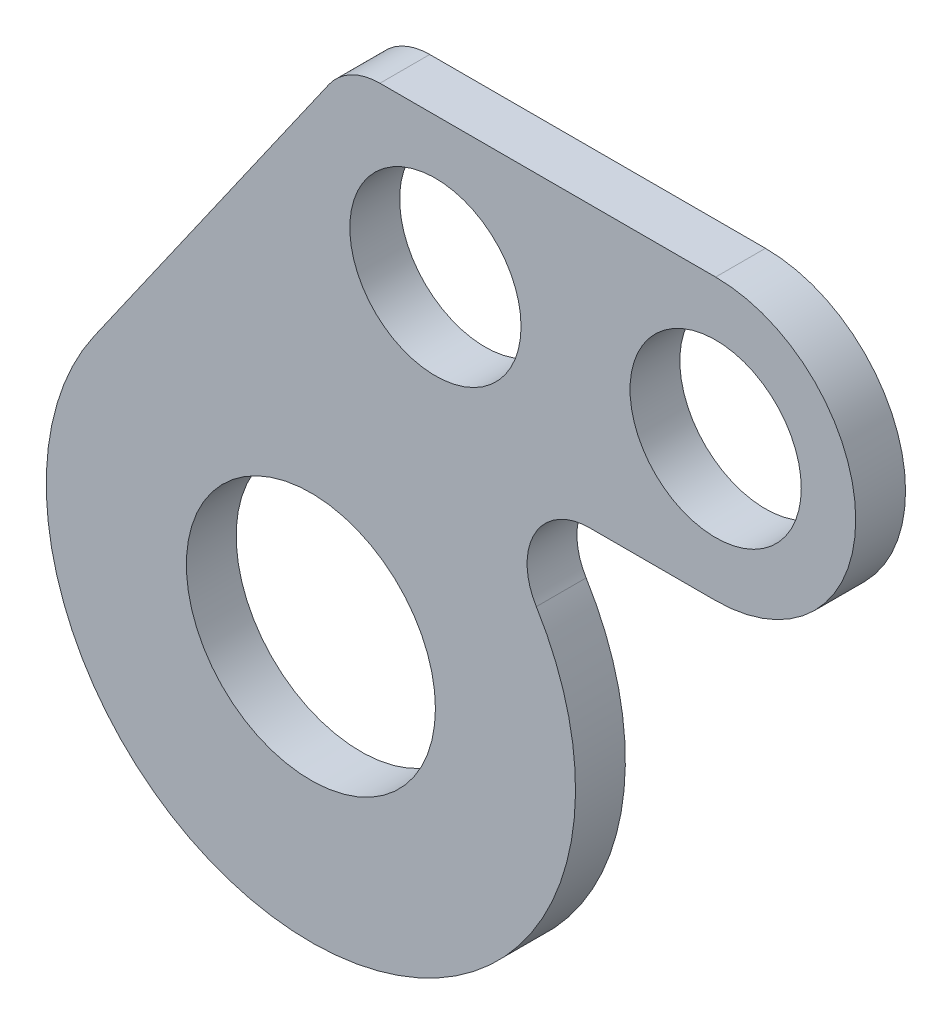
from build123d import *

# Parameters (mm, degrees)
SKETCH_1_R          = 8.5
SKETCH_1_R_2        = 4.5
EXTRUDE_1_DEPTH     = 1.6
FILLET_1_R          = 2
SKETCH_2_R          = 4
SKETCH_2_R_2        = 2.75
CUT_EXTRUDE_1_DEPTH = 1.6


with BuildPart() as part:
    # Sketch 1 → Extrude 1 (new body)
    with BuildSketch(Plane.XY):
        Circle(SKETCH_1_R)
        with BuildLine():
            ThreePointArc((13, 7.5), (8.5, 12), (13, 16.5))
            Line((13, 16.5), (1.176840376, 16.5))
            Line((1.176840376, 16.5), (-6.962792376, 4.875399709))
            ThreePointArc((-6.962792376, 4.875399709), (-1.979056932, 8.266397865), (4, 7.5))
            Line((4, 7.5), (13, 7.5))
        make_face()
        with Locations((13, 12)):
            Circle(SKETCH_1_R_2)
    extrude(amount=EXTRUDE_1_DEPTH)

    # Fillet 1
    fillet_1_edges = [part.edges().sort_by_distance(p)[0] for p in [
        (1.176840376, 16.5, 0.8),
        (4, 7.5, 0.8),
    ]]
    fillet(fillet_1_edges, radius=FILLET_1_R)

    # Sketch 2 → Cut-Extrude 1 (cut)
    with BuildSketch(Plane.XY.offset(1.6)):
        Circle(SKETCH_2_R)
        with Locations((13, 12)):
            Circle(SKETCH_2_R_2)
        with Locations((4, 12)):
            Circle(SKETCH_2_R_2)
    extrude(amount=-CUT_EXTRUDE_1_DEPTH, mode=Mode.SUBTRACT)


solid = part.part
